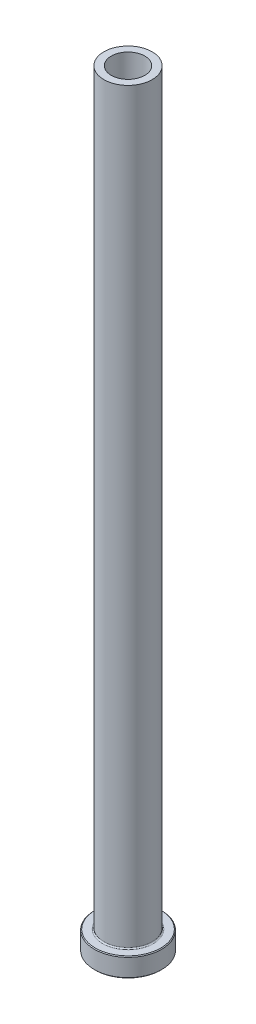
ISO-10303-21;
HEADER;
FILE_DESCRIPTION(('STEP AP214'),'2;1');
FILE_NAME('part.step','',(''),(''),'','','');
FILE_SCHEMA(('AUTOMOTIVE_DESIGN { 1 0 10303 214 1 1 1 1 }'));
ENDSEC;
DATA;
#1=APPLICATION_CONTEXT('core data for automotive mechanical design processes');
#2=APPLICATION_PROTOCOL_DEFINITION('international standard','automotive_design',2000,#1);
#3=PRODUCT_CONTEXT('',#1,'mechanical');
#4=PRODUCT('Part','Part','',(#3));
#5=PRODUCT_RELATED_PRODUCT_CATEGORY('part','',(#4));
#6=PRODUCT_DEFINITION_FORMATION('','',#4);
#7=PRODUCT_DEFINITION_CONTEXT('part definition',#1,'design');
#8=PRODUCT_DEFINITION('design','',#6,#7);
#9=PRODUCT_DEFINITION_SHAPE('','',#8);
#10=(LENGTH_UNIT() NAMED_UNIT(*) SI_UNIT(.MILLI.,.METRE.));
#11=(NAMED_UNIT(*) PLANE_ANGLE_UNIT() SI_UNIT($,.RADIAN.));
#12=(NAMED_UNIT(*) SI_UNIT($,.STERADIAN.) SOLID_ANGLE_UNIT());
#13=UNCERTAINTY_MEASURE_WITH_UNIT(LENGTH_MEASURE(1.E-05),#10,'distance_accuracy_value','');
#14=(GEOMETRIC_REPRESENTATION_CONTEXT(3) GLOBAL_UNCERTAINTY_ASSIGNED_CONTEXT((#13)) GLOBAL_UNIT_ASSIGNED_CONTEXT((#10,
#11,#12)) REPRESENTATION_CONTEXT('',''));
#15=CARTESIAN_POINT('',(0.,0.,0.));
#16=DIRECTION('',(0.,0.,1.));
#17=DIRECTION('',(1.,0.,0.));
#18=AXIS2_PLACEMENT_3D('',#15,#16,#17);
#19=CARTESIAN_POINT('',(0.,0.,0.));
#20=DIRECTION('',(0.,-1.,0.));
#21=DIRECTION('',(0.,0.,-1.));
#22=AXIS2_PLACEMENT_3D('',#19,#20,#21);
#23=PLANE('',#22);
#24=CARTESIAN_POINT('',(0.,0.,0.));
#25=DIRECTION('',(0.,-1.,0.));
#26=DIRECTION('',(0.,0.,-1.));
#27=AXIS2_PLACEMENT_3D('',#24,#25,#26);
#28=CIRCLE('',#27,10.8585);
#29=CARTESIAN_POINT('',(0.,0.,-10.8585));
#30=VERTEX_POINT('',#29);
#31=EDGE_CURVE('E44',#30,#30,#28,.T.);
#32=ORIENTED_EDGE('',*,*,#31,.T.);
#33=EDGE_LOOP('',(#32));
#34=FACE_BOUND('',#33,.T.);
#35=CARTESIAN_POINT('',(0.,0.,0.));
#36=DIRECTION('',(0.,-1.,0.));
#37=DIRECTION('',(0.,0.,-1.));
#38=AXIS2_PLACEMENT_3D('',#35,#36,#37);
#39=CIRCLE('',#38,6.143625);
#40=CARTESIAN_POINT('',(0.,0.,-6.143625));
#41=VERTEX_POINT('',#40);
#42=EDGE_CURVE('E58',#41,#41,#39,.T.);
#43=ORIENTED_EDGE('',*,*,#42,.F.);
#44=EDGE_LOOP('',(#43));
#45=FACE_BOUND('',#44,.T.);
#46=ADVANCED_FACE('F29',(#34,#45),#23,.T.);
#47=CARTESIAN_POINT('',(0.,0.,0.));
#48=DIRECTION('',(0.,-1.,0.));
#49=DIRECTION('',(0.,0.,-1.));
#50=AXIS2_PLACEMENT_3D('',#47,#48,#49);
#51=CYLINDRICAL_SURFACE('',#50,11.1125);
#52=CARTESIAN_POINT('',(0.,0.254000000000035,0.));
#53=DIRECTION('',(0.,-1.,0.));
#54=DIRECTION('',(0.,0.,-1.));
#55=AXIS2_PLACEMENT_3D('',#52,#53,#54);
#56=CIRCLE('',#55,11.1125);
#57=CARTESIAN_POINT('',(0.,0.254000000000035,-11.1125));
#58=VERTEX_POINT('',#57);
#59=EDGE_CURVE('E36',#58,#58,#56,.F.);
#60=ORIENTED_EDGE('',*,*,#59,.T.);
#61=EDGE_LOOP('',(#60));
#62=FACE_BOUND('',#61,.T.);
#63=CARTESIAN_POINT('',(0.,6.09600000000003,0.));
#64=DIRECTION('',(0.,1.,0.));
#65=DIRECTION('',(0.,0.,1.));
#66=AXIS2_PLACEMENT_3D('',#63,#64,#65);
#67=CIRCLE('',#66,11.1125);
#68=CARTESIAN_POINT('',(0.,6.09600000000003,11.1125));
#69=VERTEX_POINT('',#68);
#70=EDGE_CURVE('E40',#69,#69,#67,.F.);
#71=ORIENTED_EDGE('',*,*,#70,.T.);
#72=EDGE_LOOP('',(#71));
#73=FACE_BOUND('',#72,.T.);
#74=ADVANCED_FACE('F103',(#62,#73),#51,.T.);
#75=CARTESIAN_POINT('',(11.1125,6.35,0.));
#76=DIRECTION('',(0.,1.,0.));
#77=DIRECTION('',(0.,0.,1.));
#78=AXIS2_PLACEMENT_3D('',#75,#76,#77);
#79=PLANE('',#78);
#80=CARTESIAN_POINT('',(0.,6.35,0.));
#81=DIRECTION('',(0.,1.,0.));
#82=DIRECTION('',(0.,0.,1.));
#83=AXIS2_PLACEMENT_3D('',#80,#81,#82);
#84=CIRCLE('',#83,10.8585);
#85=CARTESIAN_POINT('',(0.,6.35,10.8585));
#86=VERTEX_POINT('',#85);
#87=EDGE_CURVE('E10',#86,#86,#84,.T.);
#88=ORIENTED_EDGE('',*,*,#87,.T.);
#89=EDGE_LOOP('',(#88));
#90=FACE_BOUND('',#89,.T.);
#91=CARTESIAN_POINT('',(0.,6.35,0.));
#92=DIRECTION('',(0.,-1.,0.));
#93=DIRECTION('',(0.,0.,-1.));
#94=AXIS2_PLACEMENT_3D('',#91,#92,#93);
#95=CIRCLE('',#94,8.391525);
#96=CARTESIAN_POINT('',(0.,6.35,-8.391525));
#97=VERTEX_POINT('',#96);
#98=EDGE_CURVE('E49',#97,#97,#95,.T.);
#99=ORIENTED_EDGE('',*,*,#98,.T.);
#100=EDGE_LOOP('',(#99));
#101=FACE_BOUND('',#100,.T.);
#102=ADVANCED_FACE('F109',(#90,#101),#79,.T.);
#103=CARTESIAN_POINT('',(0.,6.746875,0.));
#104=DIRECTION('',(0.,-1.,0.));
#105=DIRECTION('',(0.,0.,-1.));
#106=AXIS2_PLACEMENT_3D('',#103,#104,#105);
#107=TOROIDAL_SURFACE('',#106,8.391525,0.396875);
#108=CARTESIAN_POINT('',(0.,6.746875,0.));
#109=DIRECTION('',(0.,-1.,0.));
#110=DIRECTION('',(0.,0.,-1.));
#111=AXIS2_PLACEMENT_3D('',#108,#109,#110);
#112=CIRCLE('',#111,7.99465);
#113=CARTESIAN_POINT('',(0.,6.746875,-7.99465));
#114=VERTEX_POINT('',#113);
#115=EDGE_CURVE('E52',#114,#114,#112,.T.);
#116=ORIENTED_EDGE('',*,*,#115,.T.);
#117=EDGE_LOOP('',(#116));
#118=FACE_BOUND('',#117,.T.);
#119=ORIENTED_EDGE('',*,*,#98,.F.);
#120=EDGE_LOOP('',(#119));
#121=FACE_BOUND('',#120,.T.);
#122=ADVANCED_FACE('F139',(#118,#121),#107,.F.);
#123=CARTESIAN_POINT('',(0.,0.,0.));
#124=DIRECTION('',(0.,-1.,0.));
#125=DIRECTION('',(0.,0.,-1.));
#126=AXIS2_PLACEMENT_3D('',#123,#124,#125);
#127=CYLINDRICAL_SURFACE('',#126,7.99465);
#128=CARTESIAN_POINT('',(0.,254.,0.));
#129=DIRECTION('',(0.,-1.,0.));
#130=DIRECTION('',(0.,0.,-1.));
#131=AXIS2_PLACEMENT_3D('',#128,#129,#130);
#132=CIRCLE('',#131,7.99465);
#133=CARTESIAN_POINT('',(0.,254.,-7.99465));
#134=VERTEX_POINT('',#133);
#135=EDGE_CURVE('E55',#134,#134,#132,.T.);
#136=ORIENTED_EDGE('',*,*,#135,.T.);
#137=EDGE_LOOP('',(#136));
#138=FACE_BOUND('',#137,.T.);
#139=ORIENTED_EDGE('',*,*,#115,.F.);
#140=EDGE_LOOP('',(#139));
#141=FACE_BOUND('',#140,.T.);
#142=ADVANCED_FACE('F182',(#138,#141),#127,.T.);
#143=CARTESIAN_POINT('',(7.99465,254.,0.));
#144=DIRECTION('',(0.,1.,0.));
#145=DIRECTION('',(0.,0.,1.));
#146=AXIS2_PLACEMENT_3D('',#143,#144,#145);
#147=PLANE('',#146);
#148=CARTESIAN_POINT('',(0.,254.,0.));
#149=DIRECTION('',(0.,-1.,0.));
#150=DIRECTION('',(0.,0.,-1.));
#151=AXIS2_PLACEMENT_3D('',#148,#149,#150);
#152=CIRCLE('',#151,5.55625);
#153=CARTESIAN_POINT('',(0.,254.,-5.55625));
#154=VERTEX_POINT('',#153);
#155=EDGE_CURVE('E70',#154,#154,#152,.T.);
#156=ORIENTED_EDGE('',*,*,#155,.T.);
#157=EDGE_LOOP('',(#156));
#158=FACE_BOUND('',#157,.T.);
#159=ORIENTED_EDGE('',*,*,#135,.F.);
#160=EDGE_LOOP('',(#159));
#161=FACE_BOUND('',#160,.T.);
#162=ADVANCED_FACE('F74',(#158,#161),#147,.T.);
#163=CARTESIAN_POINT('',(0.,0.,0.));
#164=DIRECTION('',(0.,-1.,0.));
#165=DIRECTION('',(0.,0.,-1.));
#166=AXIS2_PLACEMENT_3D('',#163,#164,#165);
#167=CONICAL_SURFACE('',#166,6.143625,0.785398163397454);
#168=CARTESIAN_POINT('',(0.,0.396875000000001,0.));
#169=DIRECTION('',(0.,-1.,0.));
#170=DIRECTION('',(0.,0.,-1.));
#171=AXIS2_PLACEMENT_3D('',#168,#169,#170);
#172=CIRCLE('',#171,5.74675);
#173=CARTESIAN_POINT('',(0.,0.396875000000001,-5.74675));
#174=VERTEX_POINT('',#173);
#175=EDGE_CURVE('E61',#174,#174,#172,.T.);
#176=ORIENTED_EDGE('',*,*,#175,.F.);
#177=EDGE_LOOP('',(#176));
#178=FACE_BOUND('',#177,.T.);
#179=ORIENTED_EDGE('',*,*,#42,.T.);
#180=EDGE_LOOP('',(#179));
#181=FACE_BOUND('',#180,.T.);
#182=ADVANCED_FACE('F93',(#178,#181),#167,.F.);
#183=CARTESIAN_POINT('',(0.,0.,0.));
#184=DIRECTION('',(0.,-1.,0.));
#185=DIRECTION('',(0.,0.,-1.));
#186=AXIS2_PLACEMENT_3D('',#183,#184,#185);
#187=CYLINDRICAL_SURFACE('',#186,5.74675);
#188=CARTESIAN_POINT('',(0.,179.5145,0.));
#189=DIRECTION('',(0.,-1.,0.));
#190=DIRECTION('',(0.,0.,-1.));
#191=AXIS2_PLACEMENT_3D('',#188,#189,#190);
#192=CIRCLE('',#191,5.74675);
#193=CARTESIAN_POINT('',(0.,179.5145,-5.74675));
#194=VERTEX_POINT('',#193);
#195=EDGE_CURVE('E64',#194,#194,#192,.T.);
#196=ORIENTED_EDGE('',*,*,#195,.F.);
#197=EDGE_LOOP('',(#196));
#198=FACE_BOUND('',#197,.T.);
#199=ORIENTED_EDGE('',*,*,#175,.T.);
#200=EDGE_LOOP('',(#199));
#201=FACE_BOUND('',#200,.T.);
#202=ADVANCED_FACE('F87',(#198,#201),#187,.F.);
#203=CARTESIAN_POINT('',(0.,179.5145,0.));
#204=DIRECTION('',(0.,-1.,0.));
#205=DIRECTION('',(0.,0.,-1.));
#206=AXIS2_PLACEMENT_3D('',#203,#204,#205);
#207=CONICAL_SURFACE('',#206,5.74675,0.0133325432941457);
#208=CARTESIAN_POINT('',(0.,193.802,0.));
#209=DIRECTION('',(0.,-1.,0.));
#210=DIRECTION('',(0.,0.,-1.));
#211=AXIS2_PLACEMENT_3D('',#208,#209,#210);
#212=CIRCLE('',#211,5.55625);
#213=CARTESIAN_POINT('',(0.,193.802,-5.55625));
#214=VERTEX_POINT('',#213);
#215=EDGE_CURVE('E67',#214,#214,#212,.T.);
#216=ORIENTED_EDGE('',*,*,#215,.F.);
#217=EDGE_LOOP('',(#216));
#218=FACE_BOUND('',#217,.T.);
#219=ORIENTED_EDGE('',*,*,#195,.T.);
#220=EDGE_LOOP('',(#219));
#221=FACE_BOUND('',#220,.T.);
#222=ADVANCED_FACE('F81',(#218,#221),#207,.F.);
#223=CARTESIAN_POINT('',(0.,0.,0.));
#224=DIRECTION('',(0.,-1.,0.));
#225=DIRECTION('',(0.,0.,-1.));
#226=AXIS2_PLACEMENT_3D('',#223,#224,#225);
#227=CYLINDRICAL_SURFACE('',#226,5.55625);
#228=ORIENTED_EDGE('',*,*,#155,.F.);
#229=EDGE_LOOP('',(#228));
#230=FACE_BOUND('',#229,.T.);
#231=ORIENTED_EDGE('',*,*,#215,.T.);
#232=EDGE_LOOP('',(#231));
#233=FACE_BOUND('',#232,.T.);
#234=ADVANCED_FACE('F77',(#230,#233),#227,.F.);
#235=CARTESIAN_POINT('',(0.,0.,0.));
#236=DIRECTION('',(0.,1.,0.));
#237=DIRECTION('',(0.,0.,1.));
#238=AXIS2_PLACEMENT_3D('',#235,#236,#237);
#239=CONICAL_SURFACE('',#238,10.8585,0.785398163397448);
#240=ORIENTED_EDGE('',*,*,#59,.F.);
#241=EDGE_LOOP('',(#240));
#242=FACE_BOUND('',#241,.T.);
#243=ORIENTED_EDGE('',*,*,#31,.F.);
#244=EDGE_LOOP('',(#243));
#245=FACE_BOUND('',#244,.T.);
#246=ADVANCED_FACE('F80',(#242,#245),#239,.T.);
#247=CARTESIAN_POINT('',(0.,6.09600000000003,0.));
#248=DIRECTION('',(0.,-1.,0.));
#249=DIRECTION('',(0.,0.,-1.));
#250=AXIS2_PLACEMENT_3D('',#247,#248,#249);
#251=CONICAL_SURFACE('',#250,11.1125,0.785398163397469);
#252=ORIENTED_EDGE('',*,*,#87,.F.);
#253=EDGE_LOOP('',(#252));
#254=FACE_BOUND('',#253,.T.);
#255=ORIENTED_EDGE('',*,*,#70,.F.);
#256=EDGE_LOOP('',(#255));
#257=FACE_BOUND('',#256,.T.);
#258=ADVANCED_FACE('F31',(#254,#257),#251,.T.);
#259=CLOSED_SHELL('',(#46,#74,#102,#122,#142,#162,#182,#202,#222,#234,#246,#258));
#260=MANIFOLD_SOLID_BREP('B2',#259);
#261=ADVANCED_BREP_SHAPE_REPRESENTATION('',(#18,#260),#14);
#262=SHAPE_DEFINITION_REPRESENTATION(#9,#261);
ENDSEC;
END-ISO-10303-21;
